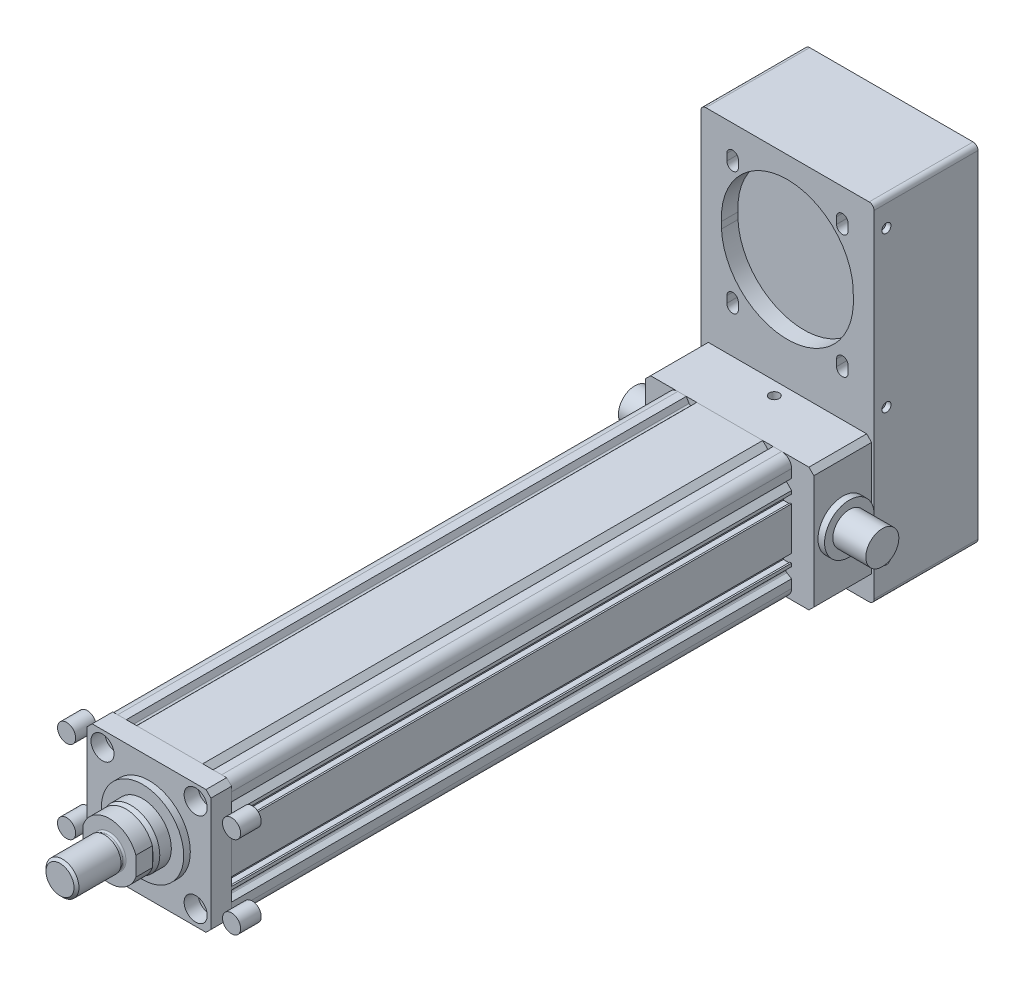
from build123d import *

# Parameters (mm, degrees)
SKETCH_1_R           = 31.5
SKETCH_1_R_2         = 3.35
EXTRUDE_1_DEPTH      = 339.5
SKETCH_2_R           = 5.5
EXTRUDE_1_2_DEPTH    = 12.5
EXTRUDE_1_2_2_DEPTH  = 12.5
EXTRUDE_1_2_3_DEPTH  = 12.5
EXTRUDE_1_2_4_DEPTH  = 12.5
SKETCH_2_R_2         = 4.25
EXTRUDE_1_2_5_DEPTH  = 12.5
SKETCH_3_R           = 7
SKETCH_3_R_2         = 4.25
CUT_EXTRUDE_1_DEPTH  = 8.5
SKETCH_3_3_R         = 25
EXTRUDE_2_DEPTH      = 4
SKETCH_5_R           = 17.5
EXTRUDE_3_DEPTH      = 10
CHAMFER_1_SIZE       = 3
CHAMFER_1_SIZE2      = 1
EXTRUDE_4_DEPTH      = 10
SKETCH_8_R           = 9
EXTRUDE_5_DEPTH      = 3
SKETCH_9_R           = 10
EXTRUDE_6_DEPTH      = 27
CHAMFER_2_SIZE       = 1.5
FILLET_1_R           = 1
EXTRUDE_7_DEPTH      = 35
SKETCH_18_W          = 105
SKETCH_18_H          = 210
EXTRUDE_11_DEPTH     = 63
CUT_EXTRUDE_7_DEPTH  = 10
CUT_EXTRUDE_START    = -10
CUT_EXTRUDE_9_DEPTH  = 5
SKETCH_21_R          = 2.75
CUT_EXTRUDE_10_DEPTH = 3
SKETCH_22_R          = 2.75
CUT_EXTRUDE_11_DEPTH = 3
SKETCH_23_R          = 3
CUT_EXTRUDE_12_DEPTH = 5
SKETCH_24_R          = 15
EXTRUDE_12_DEPTH     = 4
EXTRUDE_START        = -102
SKETCH_24_2_R        = 15
EXTRUDE_13_DEPTH     = 4
SKETCH_25_R          = 10
EXTRUDE_14_DEPTH     = 20
EXTRUDE_START_2      = -110
SKETCH_25_2_R        = 10
EXTRUDE_15_DEPTH     = 20
CHAMFER_3_SIZE       = 3
FILLET_2_R           = 3


with BuildPart() as part:
    # Sketch 1 → Extrude 1 (new body)
    with BuildSketch(Plane.XY):
        with BuildLine():
            Line((-31.5, 37.5), (-26.33, 37.5))
            Line((-26.33, 37.5), (-24.66467188, 34.615567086))
            ThreePointArc((-24.66467188, 34.615567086), (-23.929172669, 34.124122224), (-23.091539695, 34.408460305))
            Line((-23.091539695, 34.408460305), (-20, 37.5))
            Line((-20, 37.5), (20, 37.5))
            Line((20, 37.5), (23.091539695, 34.408460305))
            ThreePointArc((23.091539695, 34.408460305), (23.929172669, 34.124122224), (24.66467188, 34.615567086))
            Line((24.66467188, 34.615567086), (26.33, 37.5))
            Line((26.33, 37.5), (31.5, 37.5))
            ThreePointArc((31.5, 37.5), (35.742640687, 35.742640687), (37.5, 31.5))
            Line((37.5, 31.5), (37.5, 26.33))
            Line((37.5, 26.33), (34.615567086, 24.66467188))
            ThreePointArc((34.615567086, 24.66467188), (34.124122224, 23.929172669), (34.408460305, 23.091539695))
            Line((34.408460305, 23.091539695), (37.5, 20))
            Line((37.5, 20), (37.5, 18.1))
            Line((37.5, 18.1), (36.5, 18.1))
            Line((36.5, 18.1), (36.5, 18.7))
            Line((36.5, 18.7), (32.5, 18.7))
            Line((32.5, 18.7), (32.5, 12.4))
            Line((32.5, 12.4), (36.5, 12.4))
            Line((36.5, 12.4), (36.5, 13))
            Line((36.5, 13), (37.5, 13))
            Line((37.5, 13), (37.5, -13))
            Line((37.5, -13), (36.5, -13))
            Line((36.5, -13), (36.5, -12.4))
            Line((36.5, -12.4), (32.5, -12.4))
            Line((32.5, -12.4), (32.5, -18.7))
            Line((32.5, -18.7), (36.5, -18.7))
            Line((36.5, -18.7), (36.5, -18.1))
            Line((36.5, -18.1), (37.5, -18.1))
            Line((37.5, -18.1), (37.5, -20))
            Line((37.5, -20), (34.408460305, -23.091539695))
            ThreePointArc((34.408460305, -23.091539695), (34.124122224, -23.929172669), (34.615567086, -24.66467188))
            Line((34.615567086, -24.66467188), (37.5, -26.33))
            Line((37.5, -26.33), (37.5, -31.5))
            ThreePointArc((37.5, -31.5), (35.742640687, -35.742640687), (31.5, -37.5))
            Line((31.5, -37.5), (26.33, -37.5))
            Line((26.33, -37.5), (24.66467188, -34.615567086))
            ThreePointArc((24.66467188, -34.615567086), (23.929172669, -34.124122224), (23.091539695, -34.408460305))
            Line((23.091539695, -34.408460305), (20, -37.5))
            Line((20, -37.5), (18.1, -37.5))
            Line((18.1, -37.5), (18.1, -36.5))
            Line((18.1, -36.5), (18.7, -36.5))
            Line((18.7, -36.5), (18.7, -33.945032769))
            Line((18.7, -33.945032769), (12.4, -33.945032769))
            Line((12.4, -33.945032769), (12.4, -36.5))
            Line((12.4, -36.5), (13, -36.5))
            Line((13, -36.5), (13, -37.5))
            Line((13, -37.5), (-13, -37.5))
            Line((-13, -37.5), (-13, -36.5))
            Line((-13, -36.5), (-12.4, -36.5))
            Line((-12.4, -36.5), (-12.4, -33.945032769))
            Line((-12.4, -33.945032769), (-18.7, -33.945032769))
            Line((-18.7, -33.945032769), (-18.7, -36.5))
            Line((-18.7, -36.5), (-18.1, -36.5))
            Line((-18.1, -36.5), (-18.1, -37.5))
            Line((-18.1, -37.5), (-20, -37.5))
            Line((-20, -37.5), (-23.091539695, -34.408460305))
            ThreePointArc((-23.091539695, -34.408460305), (-23.929172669, -34.124122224), (-24.66467188, -34.615567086))
            Line((-24.66467188, -34.615567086), (-26.33, -37.5))
            Line((-26.33, -37.5), (-31.5, -37.5))
            ThreePointArc((-31.5, -37.5), (-35.742640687, -35.742640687), (-37.5, -31.5))
            Line((-37.5, -31.5), (-37.5, -26.33))
            Line((-37.5, -26.33), (-34.615567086, -24.66467188))
            ThreePointArc((-34.615567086, -24.66467188), (-34.124122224, -23.929172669), (-34.408460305, -23.091539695))
            Line((-34.408460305, -23.091539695), (-37.5, -20))
            Line((-37.5, -20), (-37.5, -18.1))
            Line((-37.5, -18.1), (-36.5, -18.1))
            Line((-36.5, -18.1), (-36.5, -18.7))
            Line((-36.5, -18.7), (-32.5, -18.7))
            Line((-32.5, -18.7), (-32.5, -12.4))
            Line((-32.5, -12.4), (-36.5, -12.4))
            Line((-36.5, -12.4), (-36.5, -13))
            Line((-36.5, -13), (-37.5, -13))
            Line((-37.5, -13), (-37.5, 13))
            Line((-37.5, 13), (-36.5, 13))
            Line((-36.5, 13), (-36.5, 12.4))
            Line((-36.5, 12.4), (-32.5, 12.4))
            Line((-32.5, 12.4), (-32.5, 18.7))
            Line((-32.5, 18.7), (-36.5, 18.7))
            Line((-36.5, 18.7), (-36.5, 18.1))
            Line((-36.5, 18.1), (-37.5, 18.1))
            Line((-37.5, 18.1), (-37.5, 20))
            Line((-37.5, 20), (-34.408460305, 23.091539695))
            ThreePointArc((-34.408460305, 23.091539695), (-34.124122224, 23.929172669), (-34.615567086, 24.66467188))
            Line((-34.615567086, 24.66467188), (-37.5, 26.33))
            Line((-37.5, 26.33), (-37.5, 31.5))
            ThreePointArc((-37.5, 31.5), (-35.742640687, 35.742640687), (-31.5, 37.5))
        make_face()
        Circle(SKETCH_1_R, mode=Mode.SUBTRACT)
        with Locations((-28.25, 28.25)):
            Circle(SKETCH_1_R_2, mode=Mode.SUBTRACT)
        with Locations(Location((28.25, 28.25, 0), (0, 0, 180))):
            Circle(SKETCH_1_R_2, mode=Mode.SUBTRACT)
        with Locations((28.25, -28.25)):
            Circle(SKETCH_1_R_2, mode=Mode.SUBTRACT)
        with Locations(Location((-28.25, -28.25, 0), (0, 0, 180))):
            Circle(SKETCH_1_R_2, mode=Mode.SUBTRACT)
    extrude(amount=EXTRUDE_1_DEPTH)


with BuildPart() as body_2:
    # Sketch 2 → Extrude 1 2 (new body)
    with BuildSketch(Plane.XY.offset(339.5)):
        with Locations((-50, 25)):
            Circle(SKETCH_2_R)
    extrude(amount=EXTRUDE_1_2_DEPTH)


with BuildPart() as body_3:
    # Sketch 2 → Extrude 1 2 2 (new body)
    with BuildSketch(Plane.XY.offset(339.5)):
        with Locations(Location((50, 25, 0), (0, 0, 180))):
            Circle(SKETCH_2_R)
    extrude(amount=EXTRUDE_1_2_2_DEPTH)


with BuildPart() as body_4:
    # Sketch 2 → Extrude 1 2 3 (new body)
    with BuildSketch(Plane.XY.offset(339.5)):
        with Locations(Location((-50, -25, 0), (0, 0, 180))):
            Circle(SKETCH_2_R)
    extrude(amount=EXTRUDE_1_2_3_DEPTH)


with BuildPart() as body_5:
    # Sketch 2 → Extrude 1 2 4 (new body)
    with BuildSketch(Plane.XY.offset(339.5)):
        with Locations((50, -25)):
            Circle(SKETCH_2_R)
    extrude(amount=EXTRUDE_1_2_4_DEPTH)


with BuildPart() as body_6:
    # Sketch 2 → Extrude 1 2 5 (new body)
    with BuildSketch(Plane.XY.offset(339.5)):
        Polygon((-37.5, 34.5), (-34.5, 37.5), (34.5, 37.5), (37.5, 34.5), (37.5, -34.5), (34.5, -37.5), (-34.5, -37.5), (-37.5, -34.5), align=None)
        with Locations((-28.25, 28.25)):
            Circle(SKETCH_2_R_2, mode=Mode.SUBTRACT)
        with Locations(Location((28.25, 28.25, 0), (0, 0, 180))):
            Circle(SKETCH_2_R_2, mode=Mode.SUBTRACT)
        with Locations(Location((-28.25, -28.25, 0), (0, 0, 180))):
            Circle(SKETCH_2_R_2, mode=Mode.SUBTRACT)
        with Locations((28.25, -28.25)):
            Circle(SKETCH_2_R_2, mode=Mode.SUBTRACT)
    extrude(amount=EXTRUDE_1_2_5_DEPTH)

    # Sketch 3 → Cut-Extrude 1 (cut)
    # profile 1 of 4: a face of its own
    with BuildSketch(Plane.XY.offset(352)):
        with Locations((28.25, -28.25)):
            Circle(SKETCH_3_R)
        with Locations((28.25, -28.25)):
            Circle(SKETCH_3_R_2, mode=Mode.SUBTRACT)
    # profile 2 of 4: a face of its own
    with BuildSketch(Plane.XY.offset(352)):
        with Locations((-28.25, -28.25)):
            Circle(SKETCH_3_R)
        with Locations(Location((-28.25, -28.25, 0), (0, 0, 180))):
            Circle(SKETCH_3_R_2, mode=Mode.SUBTRACT)
    # profile 3 of 4: a face of its own
    with BuildSketch(Plane.XY.offset(352)):
        with Locations((-28.25, 28.25)):
            Circle(SKETCH_3_R)
    # profile 4 of 4: a face of its own
    with BuildSketch(Plane.XY.offset(352)):
        with Locations((28.25, 28.25)):
            Circle(SKETCH_3_R)
    extrude(amount=-CUT_EXTRUDE_1_DEPTH, mode=Mode.SUBTRACT)

    # Sketch 3_3 → Extrude 2 (add)
    with BuildSketch(Plane.XY.offset(352)):
        Circle(SKETCH_3_3_R)
    extrude(amount=EXTRUDE_2_DEPTH)

    # Sketch 5 → Extrude 3 (add)
    with BuildSketch(Plane.XY.offset(356)):
        Circle(SKETCH_5_R)
    extrude(amount=EXTRUDE_3_DEPTH)

    # Chamfer 1
    chamfer_1_edges = [body_6.edges().sort_by_distance(p)[0] for p in [
        (-17.5, 0, 366),
    ]]
    chamfer_1_side = [body_6.faces().sort_by_distance(p)[0] for p in [
        (-17.5, 0, 361),
    ]]
    chamfer(chamfer_1_edges, length=CHAMFER_1_SIZE, length2=CHAMFER_1_SIZE2, reference=chamfer_1_side[0])

    # Sketch 6 → Extrude 4 (add)
    with BuildSketch(Plane.XY.offset(366)):
        with BuildLine():
            Line((-16, 5.744562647), (-16, -5.744562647))
            ThreePointArc((-16, -5.744562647), (0, -17), (16, -5.744562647))
            Line((16, -5.744562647), (16, 5.744562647))
            ThreePointArc((16, 5.744562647), (0, 17), (-16, 5.744562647))
        make_face()
    extrude(amount=EXTRUDE_4_DEPTH)

    # Sketch 8 → Extrude 5 (add)
    with BuildSketch(Plane.XY.offset(376)):
        Circle(SKETCH_8_R)
    extrude(amount=EXTRUDE_5_DEPTH)

    # Sketch 9 → Extrude 6 (add)
    with BuildSketch(Plane.XY.offset(379)):
        Circle(SKETCH_9_R)
    extrude(amount=EXTRUDE_6_DEPTH)

    # Chamfer 2
    chamfer_2_edges = [body_6.edges().sort_by_distance(p)[0] for p in [
        (-10, 0, 406),
    ]]
    chamfer(chamfer_2_edges, length=CHAMFER_2_SIZE)

    # Fillet 1
    fillet_1_edges = [body_6.edges().sort_by_distance(p)[0] for p in [
        (-9, 0, 376),
    ]]
    fillet(fillet_1_edges, radius=FILLET_1_R)


with BuildPart() as body_7:
    # Sketch 10 → Extrude 7 (new body)
    with BuildSketch(Plane(origin=(0, 0, 0), x_dir=(-1, 0, 0), z_dir=(0, 0, -1))):
        Polygon((-51, 31.539657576), (-51, -31.539657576), (-51, -37.5), (51, -37.5), (51, -31.539657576), (51, 31.539657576), (51, 37.5), (-51, 37.5), align=None)
    extrude(amount=EXTRUDE_7_DEPTH)

    # Sketch 23 → Cut-Extrude 12 (cut)
    with BuildSketch(Plane(origin=(0, 37.5, 0), x_dir=(1, 0, 0), z_dir=(0, 1, 0))):
        with Locations(Location((0, 27, 0), (0, 0, 270))):
            Circle(SKETCH_23_R)
    extrude(amount=-CUT_EXTRUDE_12_DEPTH, mode=Mode.SUBTRACT)

    # Sketch 24 → Extrude 12 (add)
    with BuildSketch(Plane.ZY.offset(51)):
        with Locations((-17.5, 0)):
            Circle(SKETCH_24_R)
    extrude(amount=EXTRUDE_12_DEPTH)

    # Sketch 24_2 → Extrude 13 (add)
    with BuildSketch(Plane.ZY.offset(51).offset(EXTRUDE_START)):
        with Locations((-17.5, 0)):
            Circle(SKETCH_24_2_R)
    extrude(amount=-EXTRUDE_13_DEPTH)

    # Sketch 25 → Extrude 14 (add)
    with BuildSketch(Plane.ZY.offset(55)):
        with Locations((-17.5, 0)):
            Circle(SKETCH_25_R)
    extrude(amount=EXTRUDE_14_DEPTH)

    # Chamfer 3
    chamfer_3_edges = [body_7.edges().sort_by_distance(p)[0] for p in [
        (51, -37.5, -17.5),
        (51, 37.5, -17.5),
        (-51, 37.5, -17.5),
        (-51, -37.5, -17.5),
    ]]
    chamfer(chamfer_3_edges, length=CHAMFER_3_SIZE)


with BuildPart() as body_8:
    # Sketch 18 → Extrude 11 (new body)
    with BuildSketch(Plane(origin=(0, 0, -35), x_dir=(-1, 0, 0), z_dir=(0, 0, -1))):
        with Locations((0, 55)):
            Rectangle(SKETCH_18_W, SKETCH_18_H)
    extrude(amount=EXTRUDE_11_DEPTH)

    # Sketch 19 → Cut-Extrude 7 (cut)
    with BuildSketch(Plane.XY.offset(-35)):
        with BuildLine():
            Line((-40, 105), (-40, 101))
            ThreePointArc((-40, 101), (-0.049906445, 62.997504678), (39.90018711, 101))
            Line((39.90018711, 101), (39.90018711, 105))
            ThreePointArc((39.90018711, 105), (-0.049906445, 146.997504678), (-40, 105))
        make_face()
        with BuildLine():
            Line((-36.761032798, 138.332341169), (-36.761032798, 142.332341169))
            ThreePointArc((-36.761032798, 142.332341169), (-33.261032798, 145.832341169), (-29.761032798, 142.332341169))
            Line((-29.761032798, 142.332341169), (-29.761032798, 138.332341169))
            ThreePointArc((-29.761032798, 138.332341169), (-33.261032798, 134.832341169), (-36.761032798, 138.332341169))
        make_face()
        with BuildLine():
            Line((36.761032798, 138.332341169), (36.761032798, 142.332341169))
            ThreePointArc((36.761032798, 142.332341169), (33.261032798, 145.832341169), (29.761032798, 142.332341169))
            Line((29.761032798, 142.332341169), (29.761032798, 138.332341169))
            ThreePointArc((29.761032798, 138.332341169), (33.261032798, 134.832341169), (36.761032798, 138.332341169))
        make_face()
        with BuildLine():
            Line((36.761032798, 67.667658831), (36.761032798, 63.667658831))
            ThreePointArc((36.761032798, 63.667658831), (33.261032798, 60.167658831), (29.761032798, 63.667658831))
            Line((29.761032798, 63.667658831), (29.761032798, 67.667658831))
            ThreePointArc((29.761032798, 67.667658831), (33.261032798, 71.167658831), (36.761032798, 67.667658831))
        make_face()
        with BuildLine():
            Line((-36.761032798, 67.667658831), (-36.761032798, 63.667658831))
            ThreePointArc((-36.761032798, 63.667658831), (-33.261032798, 60.167658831), (-29.761032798, 63.667658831))
            Line((-29.761032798, 63.667658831), (-29.761032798, 67.667658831))
            ThreePointArc((-29.761032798, 67.667658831), (-33.261032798, 71.167658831), (-36.761032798, 67.667658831))
        make_face()
    extrude(amount=-CUT_EXTRUDE_7_DEPTH, mode=Mode.SUBTRACT)

    # Sketch 19_3 → Cut-Extrude 9 (cut)
    with BuildSketch(Plane.XY.offset(-35).offset(CUT_EXTRUDE_START)):
        with BuildLine():
            Line((-38.461032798, 138.282341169), (-38.461032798, 142.382341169))
            ThreePointArc((-38.461032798, 142.382341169), (-33.261032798, 147.582341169), (-28.061032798, 142.382341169))
            Line((-28.061032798, 142.382341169), (-28.061032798, 138.282341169))
            ThreePointArc((-28.061032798, 138.282341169), (-33.261032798, 133.082341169), (-38.461032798, 138.282341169))
        make_face()
        with BuildLine():
            Line((38.461032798, 138.282341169), (38.461032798, 142.382341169))
            ThreePointArc((38.461032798, 142.382341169), (33.261032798, 147.582341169), (28.061032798, 142.382341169))
            Line((28.061032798, 142.382341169), (28.061032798, 138.282341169))
            ThreePointArc((28.061032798, 138.282341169), (33.261032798, 133.082341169), (38.461032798, 138.282341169))
        make_face()
        with BuildLine():
            Line((38.461032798, 67.717658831), (38.461032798, 63.617658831))
            ThreePointArc((38.461032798, 63.617658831), (33.261032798, 58.417658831), (28.061032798, 63.617658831))
            Line((28.061032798, 63.617658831), (28.061032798, 67.717658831))
            ThreePointArc((28.061032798, 67.717658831), (33.261032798, 72.917658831), (38.461032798, 67.717658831))
        make_face()
        with BuildLine():
            Line((-38.461032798, 67.717658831), (-38.461032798, 63.617658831))
            ThreePointArc((-38.461032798, 63.617658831), (-33.261032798, 58.417658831), (-28.061032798, 63.617658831))
            Line((-28.061032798, 63.617658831), (-28.061032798, 67.717658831))
            ThreePointArc((-28.061032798, 67.717658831), (-33.261032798, 72.917658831), (-38.461032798, 67.717658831))
        make_face()
    extrude(amount=-CUT_EXTRUDE_9_DEPTH, mode=Mode.SUBTRACT)

    # Sketch 21 → Cut-Extrude 10 (cut)
    with BuildSketch(Plane.ZY.offset(52.5)):
        with Locations(Location((-42.5, -30, 0), (0, 0, 270))):
            Circle(SKETCH_21_R)
        with Locations(Location((-42.5, 55, 0), (0, 0, 270))):
            Circle(SKETCH_21_R)
        with Locations(Location((-42.5, 149, 0), (0, 0, 270))):
            Circle(SKETCH_21_R)
    extrude(amount=-CUT_EXTRUDE_10_DEPTH, mode=Mode.SUBTRACT)

    # Sketch 22 → Cut-Extrude 11 (cut)
    with BuildSketch(Plane(origin=(52.5, 0, 0), x_dir=(0, 0, -1), z_dir=(1, 0, 0))):
        with Locations(Location((42.5, -30, 0), (0, 0, 270))):
            Circle(SKETCH_22_R)
        with Locations(Location((42.5, 50, 0), (0, 0, 90))):
            Circle(SKETCH_22_R)
        with Locations(Location((42.5, 144, 0), (0, 0, 90))):
            Circle(SKETCH_22_R)
    extrude(amount=-CUT_EXTRUDE_11_DEPTH, mode=Mode.SUBTRACT)

    # Fillet 2
    fillet_2_edges = [body_8.edges().sort_by_distance(p)[0] for p in [
        (-52.5, -50, -66.5),
        (52.5, -50, -66.5),
        (52.5, 160, -66.5),
        (-52.5, 160, -66.5),
    ]]
    fillet(fillet_2_edges, radius=FILLET_2_R)


with BuildPart() as body_9:
    # Sketch 25_2 → Extrude 15 (new body)
    with BuildSketch(Plane.ZY.offset(55).offset(EXTRUDE_START_2)):
        with Locations((-17.5, 0)):
            Circle(SKETCH_25_2_R)
    extrude(amount=-EXTRUDE_15_DEPTH)


solid = Compound([part.part, body_2.part, body_3.part, body_4.part, body_5.part, body_6.part, body_7.part, body_8.part, body_9.part])
